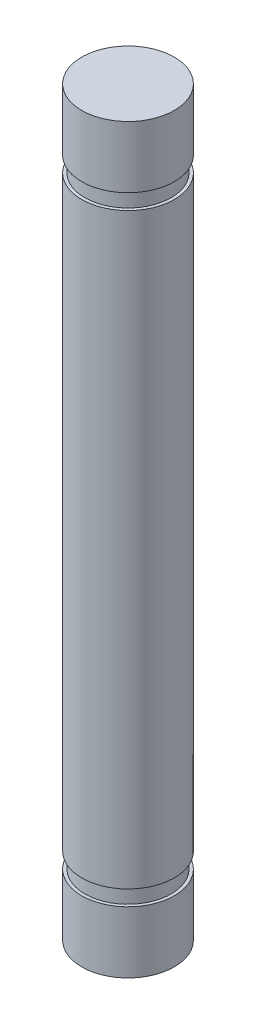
ISO-10303-21;
HEADER;
FILE_DESCRIPTION(('STEP AP214'),'2;1');
FILE_NAME('part.step','',(''),(''),'','','');
FILE_SCHEMA(('AUTOMOTIVE_DESIGN { 1 0 10303 214 1 1 1 1 }'));
ENDSEC;
DATA;
#1=APPLICATION_CONTEXT('core data for automotive mechanical design processes');
#2=APPLICATION_PROTOCOL_DEFINITION('international standard','automotive_design',2000,#1);
#3=PRODUCT_CONTEXT('',#1,'mechanical');
#4=PRODUCT('Part','Part','',(#3));
#5=PRODUCT_RELATED_PRODUCT_CATEGORY('part','',(#4));
#6=PRODUCT_DEFINITION_FORMATION('','',#4);
#7=PRODUCT_DEFINITION_CONTEXT('part definition',#1,'design');
#8=PRODUCT_DEFINITION('design','',#6,#7);
#9=PRODUCT_DEFINITION_SHAPE('','',#8);
#10=(LENGTH_UNIT() NAMED_UNIT(*) SI_UNIT(.MILLI.,.METRE.));
#11=(NAMED_UNIT(*) PLANE_ANGLE_UNIT() SI_UNIT($,.RADIAN.));
#12=(NAMED_UNIT(*) SI_UNIT($,.STERADIAN.) SOLID_ANGLE_UNIT());
#13=UNCERTAINTY_MEASURE_WITH_UNIT(LENGTH_MEASURE(1.E-05),#10,'distance_accuracy_value','');
#14=(GEOMETRIC_REPRESENTATION_CONTEXT(3) GLOBAL_UNCERTAINTY_ASSIGNED_CONTEXT((#13)) GLOBAL_UNIT_ASSIGNED_CONTEXT((#10,
#11,#12)) REPRESENTATION_CONTEXT('',''));
#15=CARTESIAN_POINT('',(0.,0.,0.));
#16=DIRECTION('',(0.,0.,1.));
#17=DIRECTION('',(1.,0.,0.));
#18=AXIS2_PLACEMENT_3D('',#15,#16,#17);
#19=CARTESIAN_POINT('',(0.,9.525,0.));
#20=DIRECTION('',(0.,-1.,0.));
#21=DIRECTION('',(0.,0.,-1.));
#22=AXIS2_PLACEMENT_3D('',#19,#20,#21);
#23=CYLINDRICAL_SURFACE('',#22,1.5);
#24=CARTESIAN_POINT('',(0.,9.525,0.));
#25=DIRECTION('',(0.,1.,0.));
#26=DIRECTION('',(0.,0.,1.));
#27=AXIS2_PLACEMENT_3D('',#24,#25,#26);
#28=CIRCLE('',#27,1.5);
#29=CARTESIAN_POINT('',(0.,9.525,-1.5));
#30=VERTEX_POINT('',#29);
#31=EDGE_CURVE('E45',#30,#30,#28,.T.);
#32=CARTESIAN_POINT('',(0.,-9.525,0.));
#33=DIRECTION('',(0.,1.,0.));
#34=DIRECTION('',(0.,0.,1.));
#35=AXIS2_PLACEMENT_3D('',#32,#33,#34);
#36=CIRCLE('',#35,1.5);
#37=CARTESIAN_POINT('',(0.,-9.525,-1.5));
#38=VERTEX_POINT('',#37);
#39=EDGE_CURVE('E41',#38,#38,#36,.T.);
#40=CARTESIAN_POINT('',(0.,9.525,-1.5));
#41=CARTESIAN_POINT('',(0.,9.3265625,-1.5));
#42=CARTESIAN_POINT('',(0.,9.128125,-1.5));
#43=CARTESIAN_POINT('',(0.,8.73125,-1.5));
#44=CARTESIAN_POINT('',(0.,8.5328125,-1.5));
#45=CARTESIAN_POINT('',(0.,8.1359375,-1.5));
#46=CARTESIAN_POINT('',(0.,7.9375,-1.5));
#47=CARTESIAN_POINT('',(0.,7.540625,-1.5));
#48=CARTESIAN_POINT('',(0.,7.3421875,-1.5));
#49=CARTESIAN_POINT('',(0.,6.9453125,-1.5));
#50=CARTESIAN_POINT('',(0.,6.746875,-1.5));
#51=CARTESIAN_POINT('',(0.,6.35,-1.5));
#52=CARTESIAN_POINT('',(0.,6.1515625,-1.5));
#53=CARTESIAN_POINT('',(0.,5.7546875,-1.5));
#54=CARTESIAN_POINT('',(0.,5.55625,-1.5));
#55=CARTESIAN_POINT('',(0.,5.159375,-1.5));
#56=CARTESIAN_POINT('',(0.,4.9609375,-1.5));
#57=CARTESIAN_POINT('',(0.,4.5640625,-1.5));
#58=CARTESIAN_POINT('',(0.,4.365625,-1.5));
#59=CARTESIAN_POINT('',(0.,3.96875,-1.5));
#60=CARTESIAN_POINT('',(0.,3.7703125,-1.5));
#61=CARTESIAN_POINT('',(0.,3.3734375,-1.5));
#62=CARTESIAN_POINT('',(0.,3.175,-1.5));
#63=CARTESIAN_POINT('',(0.,2.778125,-1.5));
#64=CARTESIAN_POINT('',(0.,2.5796875,-1.5));
#65=CARTESIAN_POINT('',(0.,2.1828125,-1.5));
#66=CARTESIAN_POINT('',(0.,1.984375,-1.5));
#67=CARTESIAN_POINT('',(0.,1.5875,-1.5));
#68=CARTESIAN_POINT('',(0.,1.3890625,-1.5));
#69=CARTESIAN_POINT('',(0.,0.992187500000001,-1.5));
#70=CARTESIAN_POINT('',(0.,0.793750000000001,-1.5));
#71=CARTESIAN_POINT('',(0.,0.396875,-1.5));
#72=CARTESIAN_POINT('',(0.,0.1984375,-1.5));
#73=CARTESIAN_POINT('',(0.,-0.1984375,-1.5));
#74=CARTESIAN_POINT('',(0.,-0.396875,-1.5));
#75=CARTESIAN_POINT('',(0.,-0.793750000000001,-1.5));
#76=CARTESIAN_POINT('',(0.,-0.992187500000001,-1.5));
#77=CARTESIAN_POINT('',(0.,-1.3890625,-1.5));
#78=CARTESIAN_POINT('',(0.,-1.5875,-1.5));
#79=CARTESIAN_POINT('',(0.,-1.984375,-1.5));
#80=CARTESIAN_POINT('',(0.,-2.1828125,-1.5));
#81=CARTESIAN_POINT('',(0.,-2.5796875,-1.5));
#82=CARTESIAN_POINT('',(0.,-2.778125,-1.5));
#83=CARTESIAN_POINT('',(0.,-3.175,-1.5));
#84=CARTESIAN_POINT('',(0.,-3.3734375,-1.5));
#85=CARTESIAN_POINT('',(0.,-3.7703125,-1.5));
#86=CARTESIAN_POINT('',(0.,-3.96875,-1.5));
#87=CARTESIAN_POINT('',(0.,-4.365625,-1.5));
#88=CARTESIAN_POINT('',(0.,-4.5640625,-1.5));
#89=CARTESIAN_POINT('',(0.,-4.9609375,-1.5));
#90=CARTESIAN_POINT('',(0.,-5.159375,-1.5));
#91=CARTESIAN_POINT('',(0.,-5.55625,-1.5));
#92=CARTESIAN_POINT('',(0.,-5.7546875,-1.5));
#93=CARTESIAN_POINT('',(0.,-6.1515625,-1.5));
#94=CARTESIAN_POINT('',(0.,-6.35,-1.5));
#95=CARTESIAN_POINT('',(0.,-6.746875,-1.5));
#96=CARTESIAN_POINT('',(0.,-6.9453125,-1.5));
#97=CARTESIAN_POINT('',(0.,-7.3421875,-1.5));
#98=CARTESIAN_POINT('',(0.,-7.540625,-1.5));
#99=CARTESIAN_POINT('',(0.,-7.9375,-1.5));
#100=CARTESIAN_POINT('',(0.,-8.1359375,-1.5));
#101=CARTESIAN_POINT('',(0.,-8.5328125,-1.5));
#102=CARTESIAN_POINT('',(0.,-8.73125,-1.5));
#103=CARTESIAN_POINT('',(0.,-9.128125,-1.5));
#104=CARTESIAN_POINT('',(0.,-9.3265625,-1.5));
#105=CARTESIAN_POINT('',(0.,-9.525,-1.5));
#106=B_SPLINE_CURVE_WITH_KNOTS('',3,(#40,#41,#42,#43,#44,#45,#46,#47,#48,#49,#50,#51,#52,#53,
#54,#55,#56,#57,#58,#59,#60,#61,#62,#63,#64,#65,#66,#67,#68,#69,#70,#71,#72,#73,#74,#75,#76,#77,
#78,#79,#80,#81,#82,#83,#84,#85,#86,#87,#88,#89,#90,#91,#92,#93,#94,#95,#96,#97,#98,#99,#100,
#101,#102,#103,#104,#105),.UNSPECIFIED.,.F.,.F.,(4,2,2,2,2,2,2,2,2,2,2,2,2,2,2,2,2,2,2,2,2,2,2,
2,2,2,2,2,2,2,2,2,4),(0.,0.5953125,1.190625,1.7859375,2.38125,2.9765625,3.571875,4.1671875,
4.7625,5.3578125,5.953125,6.5484375,7.14375,7.7390625,8.334375,8.9296875,9.525,10.1203125,
10.715625,11.3109375,11.90625,12.5015625,13.096875,13.6921875,14.2875,14.8828125,15.478125,
16.0734375,16.66875,17.2640625,17.859375,18.4546875,19.05),.UNSPECIFIED.);
#107=EDGE_CURVE('BSEAM38',#30,#38,#106,.T.);
#108=ORIENTED_EDGE('',*,*,#31,.F.);
#109=ORIENTED_EDGE('',*,*,#39,.T.);
#110=ORIENTED_EDGE('',*,*,#107,.T.);
#111=ORIENTED_EDGE('',*,*,#107,.F.);
#112=EDGE_LOOP('',(#108,#110,#109,#111));
#113=FACE_BOUND('',#112,.T.);
#114=ADVANCED_FACE('F38',(#113),#23,.T.);
#115=CARTESIAN_POINT('',(0.,9.525,0.));
#116=DIRECTION('',(0.,1.,0.));
#117=DIRECTION('',(0.,0.,1.));
#118=AXIS2_PLACEMENT_3D('',#115,#116,#117);
#119=PLANE('',#118);
#120=CARTESIAN_POINT('',(0.,9.525,0.));
#121=DIRECTION('',(0.,1.,0.));
#122=DIRECTION('',(0.,0.,1.));
#123=AXIS2_PLACEMENT_3D('',#120,#121,#122);
#124=CIRCLE('',#123,1.4);
#125=CARTESIAN_POINT('',(0.,9.525,1.4));
#126=VERTEX_POINT('',#125);
#127=EDGE_CURVE('E10',#126,#126,#124,.T.);
#128=ORIENTED_EDGE('',*,*,#127,.F.);
#129=EDGE_LOOP('',(#128));
#130=FACE_BOUND('',#129,.T.);
#131=ORIENTED_EDGE('',*,*,#31,.T.);
#132=EDGE_LOOP('',(#131));
#133=FACE_BOUND('',#132,.T.);
#134=ADVANCED_FACE('F89',(#130,#133),#119,.T.);
#135=CARTESIAN_POINT('',(0.,-9.525,0.));
#136=DIRECTION('',(0.,1.,0.));
#137=DIRECTION('',(0.,0.,1.));
#138=AXIS2_PLACEMENT_3D('',#135,#136,#137);
#139=PLANE('',#138);
#140=CARTESIAN_POINT('',(0.,-9.525,0.));
#141=DIRECTION('',(0.,1.,0.));
#142=DIRECTION('',(0.,0.,1.));
#143=AXIS2_PLACEMENT_3D('',#140,#141,#142);
#144=CIRCLE('',#143,1.4);
#145=CARTESIAN_POINT('',(0.,-9.525,1.4));
#146=VERTEX_POINT('',#145);
#147=EDGE_CURVE('E58',#146,#146,#144,.T.);
#148=ORIENTED_EDGE('',*,*,#147,.T.);
#149=EDGE_LOOP('',(#148));
#150=FACE_BOUND('',#149,.T.);
#151=ORIENTED_EDGE('',*,*,#39,.F.);
#152=EDGE_LOOP('',(#151));
#153=FACE_BOUND('',#152,.T.);
#154=ADVANCED_FACE('F94',(#150,#153),#139,.F.);
#155=CARTESIAN_POINT('',(0.,10.025,0.));
#156=DIRECTION('',(0.,-1.,0.));
#157=DIRECTION('',(0.,0.,-1.));
#158=AXIS2_PLACEMENT_3D('',#155,#156,#157);
#159=CYLINDRICAL_SURFACE('',#158,1.4);
#160=CARTESIAN_POINT('',(0.,10.025,0.));
#161=DIRECTION('',(0.,1.,0.));
#162=DIRECTION('',(0.,0.,1.));
#163=AXIS2_PLACEMENT_3D('',#160,#161,#162);
#164=CIRCLE('',#163,1.4);
#165=CARTESIAN_POINT('',(0.,10.025,1.4));
#166=VERTEX_POINT('',#165);
#167=EDGE_CURVE('E51',#166,#166,#164,.T.);
#168=ORIENTED_EDGE('',*,*,#167,.F.);
#169=EDGE_LOOP('',(#168));
#170=FACE_BOUND('',#169,.T.);
#171=ORIENTED_EDGE('',*,*,#127,.T.);
#172=EDGE_LOOP('',(#171));
#173=FACE_BOUND('',#172,.T.);
#174=ADVANCED_FACE('F103',(#170,#173),#159,.T.);
#175=CARTESIAN_POINT('',(0.,12.025,0.));
#176=DIRECTION('',(0.,-1.,0.));
#177=DIRECTION('',(0.,0.,-1.));
#178=AXIS2_PLACEMENT_3D('',#175,#176,#177);
#179=CYLINDRICAL_SURFACE('',#178,1.5);
#180=CARTESIAN_POINT('',(0.,12.025,0.));
#181=DIRECTION('',(0.,1.,0.));
#182=DIRECTION('',(0.,0.,1.));
#183=AXIS2_PLACEMENT_3D('',#180,#181,#182);
#184=CIRCLE('',#183,1.5);
#185=CARTESIAN_POINT('',(0.,12.025,1.5));
#186=VERTEX_POINT('',#185);
#187=EDGE_CURVE('E54',#186,#186,#184,.T.);
#188=ORIENTED_EDGE('',*,*,#187,.F.);
#189=EDGE_LOOP('',(#188));
#190=FACE_BOUND('',#189,.T.);
#191=CARTESIAN_POINT('',(0.,10.025,0.));
#192=DIRECTION('',(0.,1.,0.));
#193=DIRECTION('',(0.,0.,1.));
#194=AXIS2_PLACEMENT_3D('',#191,#192,#193);
#195=CIRCLE('',#194,1.5);
#196=CARTESIAN_POINT('',(0.,10.025,1.5));
#197=VERTEX_POINT('',#196);
#198=EDGE_CURVE('E55',#197,#197,#195,.T.);
#199=ORIENTED_EDGE('',*,*,#198,.T.);
#200=EDGE_LOOP('',(#199));
#201=FACE_BOUND('',#200,.T.);
#202=ADVANCED_FACE('F108',(#190,#201),#179,.T.);
#203=CARTESIAN_POINT('',(0.,12.025,0.));
#204=DIRECTION('',(0.,1.,0.));
#205=DIRECTION('',(0.,0.,1.));
#206=AXIS2_PLACEMENT_3D('',#203,#204,#205);
#207=PLANE('',#206);
#208=ORIENTED_EDGE('',*,*,#187,.T.);
#209=EDGE_LOOP('',(#208));
#210=FACE_BOUND('',#209,.T.);
#211=ADVANCED_FACE('F114',(#210),#207,.T.);
#212=CARTESIAN_POINT('',(0.,10.025,0.));
#213=DIRECTION('',(0.,1.,0.));
#214=DIRECTION('',(0.,0.,1.));
#215=AXIS2_PLACEMENT_3D('',#212,#213,#214);
#216=PLANE('',#215);
#217=ORIENTED_EDGE('',*,*,#167,.T.);
#218=EDGE_LOOP('',(#217));
#219=FACE_BOUND('',#218,.T.);
#220=ORIENTED_EDGE('',*,*,#198,.F.);
#221=EDGE_LOOP('',(#220));
#222=FACE_BOUND('',#221,.T.);
#223=ADVANCED_FACE('F116',(#219,#222),#216,.F.);
#224=CARTESIAN_POINT('',(0.,-10.025,0.));
#225=DIRECTION('',(0.,1.,0.));
#226=DIRECTION('',(0.,0.,1.));
#227=AXIS2_PLACEMENT_3D('',#224,#225,#226);
#228=CYLINDRICAL_SURFACE('',#227,1.4);
#229=CARTESIAN_POINT('',(0.,-10.025,0.));
#230=DIRECTION('',(0.,1.,0.));
#231=DIRECTION('',(0.,0.,1.));
#232=AXIS2_PLACEMENT_3D('',#229,#230,#231);
#233=CIRCLE('',#232,1.4);
#234=CARTESIAN_POINT('',(0.,-10.025,1.4));
#235=VERTEX_POINT('',#234);
#236=EDGE_CURVE('E63',#235,#235,#233,.T.);
#237=ORIENTED_EDGE('',*,*,#236,.T.);
#238=EDGE_LOOP('',(#237));
#239=FACE_BOUND('',#238,.T.);
#240=ORIENTED_EDGE('',*,*,#147,.F.);
#241=EDGE_LOOP('',(#240));
#242=FACE_BOUND('',#241,.T.);
#243=ADVANCED_FACE('F86',(#239,#242),#228,.T.);
#244=CARTESIAN_POINT('',(0.,-12.025,0.));
#245=DIRECTION('',(0.,1.,0.));
#246=DIRECTION('',(0.,0.,1.));
#247=AXIS2_PLACEMENT_3D('',#244,#245,#246);
#248=CYLINDRICAL_SURFACE('',#247,1.5);
#249=CARTESIAN_POINT('',(0.,-12.025,0.));
#250=DIRECTION('',(0.,1.,0.));
#251=DIRECTION('',(0.,0.,1.));
#252=AXIS2_PLACEMENT_3D('',#249,#250,#251);
#253=CIRCLE('',#252,1.5);
#254=CARTESIAN_POINT('',(0.,-12.025,1.5));
#255=VERTEX_POINT('',#254);
#256=EDGE_CURVE('E66',#255,#255,#253,.T.);
#257=ORIENTED_EDGE('',*,*,#256,.T.);
#258=EDGE_LOOP('',(#257));
#259=FACE_BOUND('',#258,.T.);
#260=CARTESIAN_POINT('',(0.,-10.025,0.));
#261=DIRECTION('',(0.,1.,0.));
#262=DIRECTION('',(0.,0.,1.));
#263=AXIS2_PLACEMENT_3D('',#260,#261,#262);
#264=CIRCLE('',#263,1.5);
#265=CARTESIAN_POINT('',(0.,-10.025,1.5));
#266=VERTEX_POINT('',#265);
#267=EDGE_CURVE('E67',#266,#266,#264,.T.);
#268=ORIENTED_EDGE('',*,*,#267,.F.);
#269=EDGE_LOOP('',(#268));
#270=FACE_BOUND('',#269,.T.);
#271=ADVANCED_FACE('F73',(#259,#270),#248,.T.);
#272=CARTESIAN_POINT('',(0.,-12.025,0.));
#273=DIRECTION('',(0.,-1.,0.));
#274=DIRECTION('',(0.,0.,1.));
#275=AXIS2_PLACEMENT_3D('',#272,#273,#274);
#276=PLANE('',#275);
#277=ORIENTED_EDGE('',*,*,#256,.F.);
#278=EDGE_LOOP('',(#277));
#279=FACE_BOUND('',#278,.T.);
#280=ADVANCED_FACE('F76',(#279),#276,.T.);
#281=CARTESIAN_POINT('',(0.,-10.025,0.));
#282=DIRECTION('',(0.,-1.,0.));
#283=DIRECTION('',(0.,0.,1.));
#284=AXIS2_PLACEMENT_3D('',#281,#282,#283);
#285=PLANE('',#284);
#286=ORIENTED_EDGE('',*,*,#236,.F.);
#287=EDGE_LOOP('',(#286));
#288=FACE_BOUND('',#287,.T.);
#289=ORIENTED_EDGE('',*,*,#267,.T.);
#290=EDGE_LOOP('',(#289));
#291=FACE_BOUND('',#290,.T.);
#292=ADVANCED_FACE('F78',(#288,#291),#285,.F.);
#293=CLOSED_SHELL('',(#114,#134,#154,#174,#202,#211,#223,#243,#271,#280,#292));
#294=MANIFOLD_SOLID_BREP('B2',#293);
#295=ADVANCED_BREP_SHAPE_REPRESENTATION('',(#18,#294),#14);
#296=SHAPE_DEFINITION_REPRESENTATION(#9,#295);
ENDSEC;
END-ISO-10303-21;
